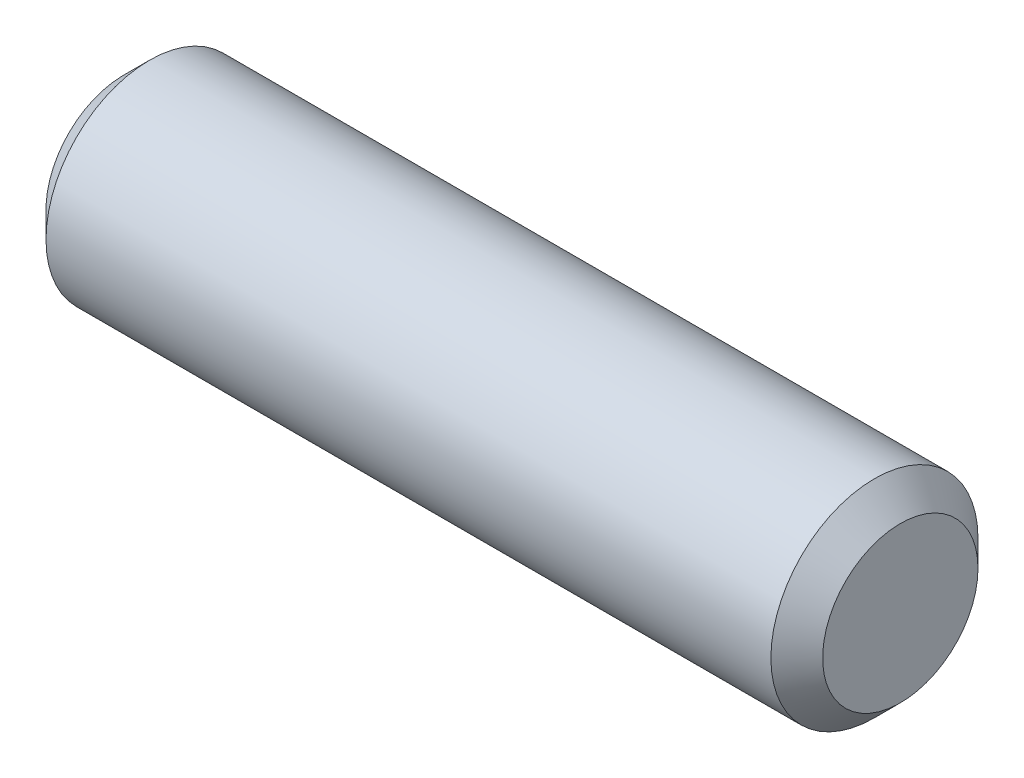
from build123d import *

# Parameters (mm, degrees)
SKETCH_1_R      = 2
EXTRUDE_1_DEPTH = 15
CHAMFER_1_SIZE  = 0.5


with BuildPart() as part:
    # Sketch 1 → Extrude 1 (new body)
    with BuildSketch(Plane(origin=(0, 0, 0), x_dir=(0, 0, -1), z_dir=(1, 0, 0))):
        Circle(SKETCH_1_R)
    extrude(amount=EXTRUDE_1_DEPTH)

    # Chamfer 1
    chamfer_1_edges = [part.edges().sort_by_distance(p)[0] for p in [
        (0, 0, 2),
        (15, 0, 2),
    ]]
    chamfer(chamfer_1_edges, length=CHAMFER_1_SIZE)


solid = part.part
